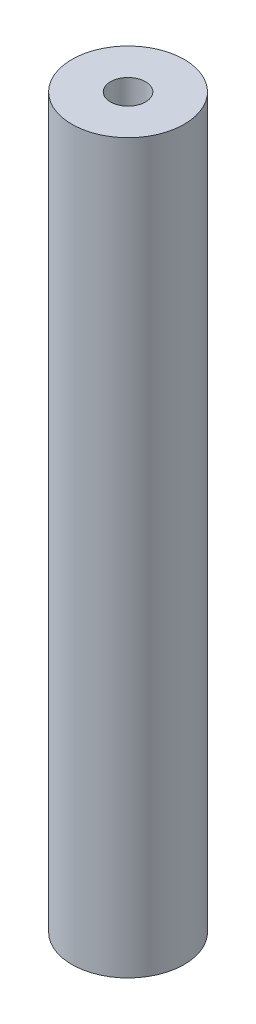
from build123d import *

# Parameters (mm, degrees)
SKETCH1_R           = 4
SKETCH1_R_2         = 1.25
BOSS_EXTRUDE1_DEPTH = 51.8
BOSS_EXTRUDE2_START = -36.8
SKETCH2_R           = 1.25
BOSS_EXTRUDE2_DEPTH = 21.8


with BuildPart() as part:
    # Sketch1 → Boss-Extrude1 (new body)
    with BuildSketch(Plane(origin=(0, 0, 0), x_dir=(1, 0, 0), z_dir=(0, 1, 0))):
        with Locations(Location((0, 0, 0), (0, 0, 90))):
            Circle(SKETCH1_R)
        with Locations(Location((0, 0, 0), (0, 0, 90))):
            Circle(SKETCH1_R_2, mode=Mode.SUBTRACT)
    extrude(amount=BOSS_EXTRUDE1_DEPTH)

    # Sketch2 → Boss-Extrude2 (add)
    with BuildSketch(Plane(origin=(0, 51.8, 0), x_dir=(1, 0, 0), z_dir=(0, 1, 0)).offset(BOSS_EXTRUDE2_START)):
        with Locations(Location((0, 0, 0), (0, 0, 90))):
            Circle(SKETCH2_R)
    extrude(amount=BOSS_EXTRUDE2_DEPTH)


solid = part.part
